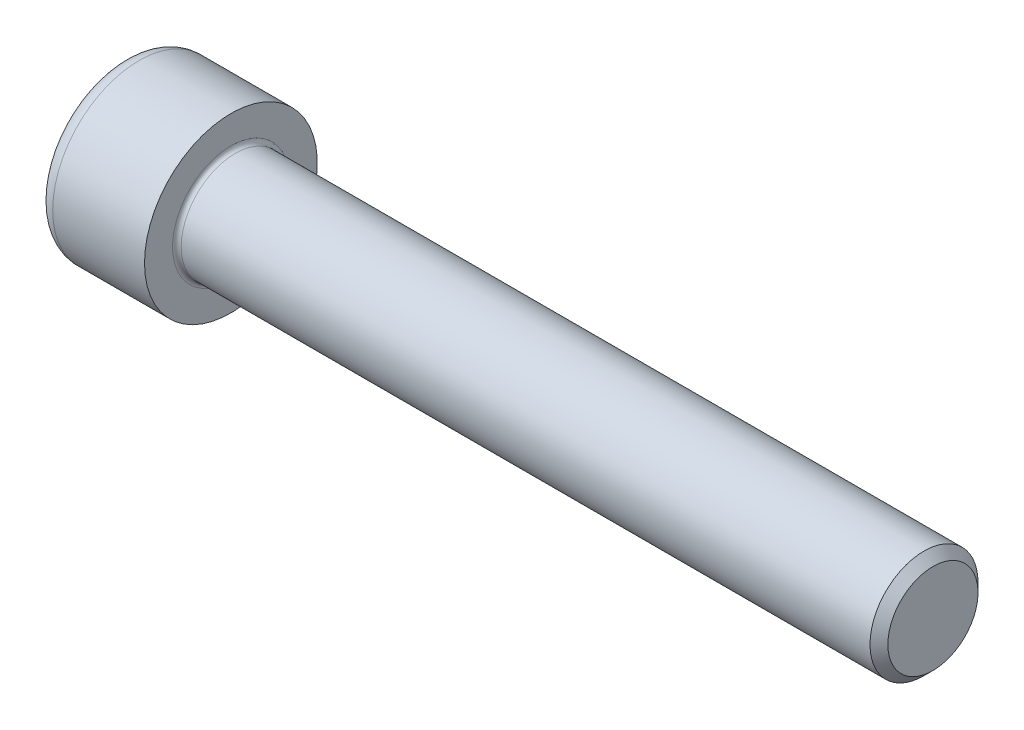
ISO-10303-21;
HEADER;
FILE_DESCRIPTION(('STEP AP214'),'2;1');
FILE_NAME('part.step','',(''),(''),'','','');
FILE_SCHEMA(('AUTOMOTIVE_DESIGN { 1 0 10303 214 1 1 1 1 }'));
ENDSEC;
DATA;
#1=APPLICATION_CONTEXT('core data for automotive mechanical design processes');
#2=APPLICATION_PROTOCOL_DEFINITION('international standard','automotive_design',2000,#1);
#3=PRODUCT_CONTEXT('',#1,'mechanical');
#4=PRODUCT('Part','Part','',(#3));
#5=PRODUCT_RELATED_PRODUCT_CATEGORY('part','',(#4));
#6=PRODUCT_DEFINITION_FORMATION('','',#4);
#7=PRODUCT_DEFINITION_CONTEXT('part definition',#1,'design');
#8=PRODUCT_DEFINITION('design','',#6,#7);
#9=PRODUCT_DEFINITION_SHAPE('','',#8);
#10=(LENGTH_UNIT() NAMED_UNIT(*) SI_UNIT(.MILLI.,.METRE.));
#11=(NAMED_UNIT(*) PLANE_ANGLE_UNIT() SI_UNIT($,.RADIAN.));
#12=(NAMED_UNIT(*) SI_UNIT($,.STERADIAN.) SOLID_ANGLE_UNIT());
#13=UNCERTAINTY_MEASURE_WITH_UNIT(LENGTH_MEASURE(1.E-05),#10,'distance_accuracy_value','');
#14=(GEOMETRIC_REPRESENTATION_CONTEXT(3) GLOBAL_UNCERTAINTY_ASSIGNED_CONTEXT((#13)) GLOBAL_UNIT_ASSIGNED_CONTEXT((#10,
#11,#12)) REPRESENTATION_CONTEXT('',''));
#15=CARTESIAN_POINT('',(0.,0.,0.));
#16=DIRECTION('',(0.,0.,1.));
#17=DIRECTION('',(1.,0.,0.));
#18=AXIS2_PLACEMENT_3D('',#15,#16,#17);
#19=CARTESIAN_POINT('',(0.,0.,0.));
#20=DIRECTION('',(-1.,0.,0.));
#21=DIRECTION('',(0.,0.,1.));
#22=AXIS2_PLACEMENT_3D('',#19,#20,#21);
#23=PLANE('',#22);
#24=DIRECTION('',(0.,-0.499999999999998,0.86602540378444));
#25=VECTOR('',#24,1.);
#26=CARTESIAN_POINT('',(0.,4.68519743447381,0.));
#27=LINE('',#26,#25);
#28=CARTESIAN_POINT('',(0.,4.68519743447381,0.));
#29=VERTEX_POINT('',#28);
#30=CARTESIAN_POINT('',(0.,2.34259871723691,4.0575));
#31=VERTEX_POINT('',#30);
#32=EDGE_CURVE('E259',#29,#31,#27,.T.);
#33=ORIENTED_EDGE('',*,*,#32,.T.);
#34=DIRECTION('',(0.,1.,0.));
#35=VECTOR('',#34,1.);
#36=CARTESIAN_POINT('',(0.,-2.3425987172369,4.0575));
#37=LINE('',#36,#35);
#38=CARTESIAN_POINT('',(0.,-2.3425987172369,4.0575));
#39=VERTEX_POINT('',#38);
#40=EDGE_CURVE('E131',#39,#31,#37,.T.);
#41=ORIENTED_EDGE('',*,*,#40,.F.);
#42=DIRECTION('',(0.,-0.500000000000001,-0.866025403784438));
#43=VECTOR('',#42,1.);
#44=CARTESIAN_POINT('',(0.,-2.3425987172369,4.0575));
#45=LINE('',#44,#43);
#46=CARTESIAN_POINT('',(0.,-4.68519743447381,0.));
#47=VERTEX_POINT('',#46);
#48=EDGE_CURVE('E262',#39,#47,#45,.T.);
#49=ORIENTED_EDGE('',*,*,#48,.T.);
#50=DIRECTION('',(0.,0.499999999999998,-0.86602540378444));
#51=VECTOR('',#50,1.);
#52=CARTESIAN_POINT('',(0.,-4.68519743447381,0.));
#53=LINE('',#52,#51);
#54=CARTESIAN_POINT('',(0.,-2.34259871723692,-4.0575));
#55=VERTEX_POINT('',#54);
#56=EDGE_CURVE('E265',#47,#55,#53,.T.);
#57=ORIENTED_EDGE('',*,*,#56,.T.);
#58=DIRECTION('',(0.,-1.,0.));
#59=VECTOR('',#58,1.);
#60=CARTESIAN_POINT('',(0.,2.34259871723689,-4.0575));
#61=LINE('',#60,#59);
#62=CARTESIAN_POINT('',(0.,2.34259871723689,-4.0575));
#63=VERTEX_POINT('',#62);
#64=EDGE_CURVE('E268',#63,#55,#61,.T.);
#65=ORIENTED_EDGE('',*,*,#64,.F.);
#66=DIRECTION('',(0.,-0.500000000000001,-0.866025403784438));
#67=VECTOR('',#66,1.);
#68=CARTESIAN_POINT('',(0.,4.68519743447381,0.));
#69=LINE('',#68,#67);
#70=EDGE_CURVE('E126',#29,#63,#69,.T.);
#71=ORIENTED_EDGE('',*,*,#70,.F.);
#72=EDGE_LOOP('',(#33,#41,#49,#57,#65,#71));
#73=FACE_BOUND('',#72,.T.);
#74=CARTESIAN_POINT('',(0.,0.,0.));
#75=DIRECTION('',(-1.,0.,0.));
#76=DIRECTION('',(0.,0.,1.));
#77=AXIS2_PLACEMENT_3D('',#74,#75,#76);
#78=CIRCLE('',#77,6.5);
#79=CARTESIAN_POINT('',(0.,0.,6.5));
#80=VERTEX_POINT('',#79);
#81=EDGE_CURVE('E43',#80,#80,#78,.T.);
#82=ORIENTED_EDGE('',*,*,#81,.T.);
#83=EDGE_LOOP('',(#82));
#84=FACE_BOUND('',#83,.T.);
#85=ADVANCED_FACE('F35',(#73,#84),#23,.T.);
#86=CARTESIAN_POINT('',(-31.75,0.,0.));
#87=DIRECTION('',(-1.,0.,0.));
#88=DIRECTION('',(0.,0.,1.));
#89=AXIS2_PLACEMENT_3D('',#86,#87,#88);
#90=CYLINDRICAL_SURFACE('',#89,8.);
#91=CARTESIAN_POINT('',(1.5,0.,0.));
#92=DIRECTION('',(-1.,0.,0.));
#93=DIRECTION('',(0.,0.,1.));
#94=AXIS2_PLACEMENT_3D('',#91,#92,#93);
#95=CIRCLE('',#94,8.);
#96=CARTESIAN_POINT('',(1.5,0.,8.));
#97=VERTEX_POINT('',#96);
#98=EDGE_CURVE('E11',#97,#97,#95,.F.);
#99=ORIENTED_EDGE('',*,*,#98,.T.);
#100=EDGE_LOOP('',(#99));
#101=FACE_BOUND('',#100,.T.);
#102=CARTESIAN_POINT('',(10.,0.,0.));
#103=DIRECTION('',(-1.,0.,0.));
#104=DIRECTION('',(0.,0.,1.));
#105=AXIS2_PLACEMENT_3D('',#102,#103,#104);
#106=CIRCLE('',#105,8.);
#107=CARTESIAN_POINT('',(10.,0.,8.));
#108=VERTEX_POINT('',#107);
#109=EDGE_CURVE('E149',#108,#108,#106,.T.);
#110=ORIENTED_EDGE('',*,*,#109,.T.);
#111=EDGE_LOOP('',(#110));
#112=FACE_BOUND('',#111,.T.);
#113=ADVANCED_FACE('F173',(#101,#112),#90,.T.);
#114=CARTESIAN_POINT('',(10.,8.,0.));
#115=DIRECTION('',(1.,0.,0.));
#116=DIRECTION('',(0.,0.,-1.));
#117=AXIS2_PLACEMENT_3D('',#114,#115,#116);
#118=PLANE('',#117);
#119=CARTESIAN_POINT('',(10.,0.,0.));
#120=DIRECTION('',(1.,0.,0.));
#121=DIRECTION('',(0.,0.,-1.));
#122=AXIS2_PLACEMENT_3D('',#119,#120,#121);
#123=CIRCLE('',#122,5.39999999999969);
#124=CARTESIAN_POINT('',(10.,0.,-5.39999999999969));
#125=VERTEX_POINT('',#124);
#126=EDGE_CURVE('E152',#125,#125,#123,.F.);
#127=ORIENTED_EDGE('',*,*,#126,.T.);
#128=EDGE_LOOP('',(#127));
#129=FACE_BOUND('',#128,.T.);
#130=ORIENTED_EDGE('',*,*,#109,.F.);
#131=EDGE_LOOP('',(#130));
#132=FACE_BOUND('',#131,.T.);
#133=ADVANCED_FACE('F179',(#129,#132),#118,.T.);
#134=CARTESIAN_POINT('',(-31.75,0.,0.));
#135=DIRECTION('',(-1.,0.,0.));
#136=DIRECTION('',(0.,0.,1.));
#137=AXIS2_PLACEMENT_3D('',#134,#135,#136);
#138=CYLINDRICAL_SURFACE('',#137,4.99999999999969);
#139=CARTESIAN_POINT('',(10.4,0.,0.));
#140=DIRECTION('',(1.,0.,0.));
#141=DIRECTION('',(0.,0.,-1.));
#142=AXIS2_PLACEMENT_3D('',#139,#140,#141);
#143=CIRCLE('',#142,4.99999999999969);
#144=CARTESIAN_POINT('',(10.4,0.,-4.99999999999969));
#145=VERTEX_POINT('',#144);
#146=EDGE_CURVE('E155',#145,#145,#143,.T.);
#147=ORIENTED_EDGE('',*,*,#146,.T.);
#148=EDGE_LOOP('',(#147));
#149=FACE_BOUND('',#148,.T.);
#150=CARTESIAN_POINT('',(74.1719999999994,0.,0.));
#151=DIRECTION('',(-1.,0.,0.));
#152=DIRECTION('',(0.,0.,1.));
#153=AXIS2_PLACEMENT_3D('',#150,#151,#152);
#154=CIRCLE('',#153,4.99999999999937);
#155=CARTESIAN_POINT('',(74.1719999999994,0.,4.99999999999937));
#156=VERTEX_POINT('',#155);
#157=EDGE_CURVE('E146',#156,#156,#154,.T.);
#158=ORIENTED_EDGE('',*,*,#157,.T.);
#159=EDGE_LOOP('',(#158));
#160=FACE_BOUND('',#159,.T.);
#161=ADVANCED_FACE('F185',(#149,#160),#138,.T.);
#162=CARTESIAN_POINT('',(75.,0.,0.));
#163=DIRECTION('',(-1.,0.,0.));
#164=DIRECTION('',(0.,0.,1.));
#165=AXIS2_PLACEMENT_3D('',#162,#163,#164);
#166=CONICAL_SURFACE('',#165,4.172,0.785398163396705);
#167=ORIENTED_EDGE('',*,*,#157,.F.);
#168=EDGE_LOOP('',(#167));
#169=FACE_BOUND('',#168,.T.);
#170=CARTESIAN_POINT('',(75.,0.,0.));
#171=DIRECTION('',(-1.,0.,0.));
#172=DIRECTION('',(0.,0.,1.));
#173=AXIS2_PLACEMENT_3D('',#170,#171,#172);
#174=CIRCLE('',#173,4.172);
#175=CARTESIAN_POINT('',(75.,0.,4.172));
#176=VERTEX_POINT('',#175);
#177=EDGE_CURVE('E142',#176,#176,#174,.T.);
#178=ORIENTED_EDGE('',*,*,#177,.T.);
#179=EDGE_LOOP('',(#178));
#180=FACE_BOUND('',#179,.T.);
#181=ADVANCED_FACE('F189',(#169,#180),#166,.T.);
#182=CARTESIAN_POINT('',(75.,4.172,0.));
#183=DIRECTION('',(1.,0.,0.));
#184=DIRECTION('',(0.,0.,-1.));
#185=AXIS2_PLACEMENT_3D('',#182,#183,#184);
#186=PLANE('',#185);
#187=ORIENTED_EDGE('',*,*,#177,.F.);
#188=EDGE_LOOP('',(#187));
#189=FACE_BOUND('',#188,.T.);
#190=ADVANCED_FACE('F169',(#189),#186,.T.);
#191=CARTESIAN_POINT('',(10.4,0.,0.));
#192=DIRECTION('',(1.,0.,0.));
#193=DIRECTION('',(0.,0.,-1.));
#194=AXIS2_PLACEMENT_3D('',#191,#192,#193);
#195=TOROIDAL_SURFACE('',#194,5.39999999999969,0.4);
#196=ORIENTED_EDGE('',*,*,#146,.F.);
#197=EDGE_LOOP('',(#196));
#198=FACE_BOUND('',#197,.T.);
#199=ORIENTED_EDGE('',*,*,#126,.F.);
#200=EDGE_LOOP('',(#199));
#201=FACE_BOUND('',#200,.T.);
#202=ADVANCED_FACE('F162',(#198,#201),#195,.F.);
#203=CARTESIAN_POINT('',(1.5,0.,0.));
#204=DIRECTION('',(-1.,0.,0.));
#205=DIRECTION('',(0.,0.,1.));
#206=AXIS2_PLACEMENT_3D('',#203,#204,#205);
#207=TOROIDAL_SURFACE('',#206,6.5,1.5);
#208=ORIENTED_EDGE('',*,*,#98,.F.);
#209=EDGE_LOOP('',(#208));
#210=FACE_BOUND('',#209,.T.);
#211=ORIENTED_EDGE('',*,*,#81,.F.);
#212=EDGE_LOOP('',(#211));
#213=FACE_BOUND('',#212,.T.);
#214=ADVANCED_FACE('F37',(#210,#213),#207,.T.);
#215=CARTESIAN_POINT('',(5.,4.68519743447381,0.));
#216=DIRECTION('',(0.,-0.86602540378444,-0.499999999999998));
#217=DIRECTION('',(0.,0.499999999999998,-0.86602540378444));
#218=AXIS2_PLACEMENT_3D('',#215,#216,#217);
#219=PLANE('',#218);
#220=ORIENTED_EDGE('',*,*,#32,.F.);
#221=DIRECTION('',(-1.,0.,0.));
#222=VECTOR('',#221,1.);
#223=CARTESIAN_POINT('',(5.,4.68519743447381,0.));
#224=LINE('',#223,#222);
#225=CARTESIAN_POINT('',(5.,4.68519743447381,0.));
#226=VERTEX_POINT('',#225);
#227=EDGE_CURVE('E249',#226,#29,#224,.T.);
#228=ORIENTED_EDGE('',*,*,#227,.F.);
#229=DIRECTION('',(0.,-0.499999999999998,0.86602540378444));
#230=VECTOR('',#229,1.);
#231=CARTESIAN_POINT('',(5.,4.68519743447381,0.));
#232=LINE('',#231,#230);
#233=CARTESIAN_POINT('',(5.,3.51389807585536,2.02874999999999));
#234=VERTEX_POINT('',#233);
#235=EDGE_CURVE('E118',#226,#234,#232,.T.);
#236=ORIENTED_EDGE('',*,*,#235,.T.);
#237=CARTESIAN_POINT('',(5.,2.34259871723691,4.0575));
#238=VERTEX_POINT('',#237);
#239=EDGE_CURVE('E109',#234,#238,#232,.T.);
#240=ORIENTED_EDGE('',*,*,#239,.T.);
#241=DIRECTION('',(-1.,0.,0.));
#242=VECTOR('',#241,1.);
#243=CARTESIAN_POINT('',(5.,2.34259871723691,4.0575));
#244=LINE('',#243,#242);
#245=EDGE_CURVE('E123',#238,#31,#244,.T.);
#246=ORIENTED_EDGE('',*,*,#245,.T.);
#247=EDGE_LOOP('',(#220,#228,#236,#240,#246));
#248=FACE_BOUND('',#247,.T.);
#249=ADVANCED_FACE('F122',(#248),#219,.T.);
#250=CARTESIAN_POINT('',(5.,-2.3425987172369,4.0575));
#251=DIRECTION('',(0.,0.,1.));
#252=DIRECTION('',(0.,-1.,0.));
#253=AXIS2_PLACEMENT_3D('',#250,#251,#252);
#254=PLANE('',#253);
#255=ORIENTED_EDGE('',*,*,#40,.T.);
#256=ORIENTED_EDGE('',*,*,#245,.F.);
#257=DIRECTION('',(0.,1.,0.));
#258=VECTOR('',#257,1.);
#259=CARTESIAN_POINT('',(5.,-2.3425987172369,4.0575));
#260=LINE('',#259,#258);
#261=CARTESIAN_POINT('',(5.,0.,4.0575));
#262=VERTEX_POINT('',#261);
#263=EDGE_CURVE('E106',#262,#238,#260,.T.);
#264=ORIENTED_EDGE('',*,*,#263,.F.);
#265=CARTESIAN_POINT('',(5.,-2.3425987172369,4.0575));
#266=VERTEX_POINT('',#265);
#267=EDGE_CURVE('E117',#266,#262,#260,.T.);
#268=ORIENTED_EDGE('',*,*,#267,.F.);
#269=DIRECTION('',(-1.,0.,0.));
#270=VECTOR('',#269,1.);
#271=CARTESIAN_POINT('',(5.,-2.3425987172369,4.0575));
#272=LINE('',#271,#270);
#273=EDGE_CURVE('E133',#266,#39,#272,.T.);
#274=ORIENTED_EDGE('',*,*,#273,.T.);
#275=EDGE_LOOP('',(#255,#256,#264,#268,#274));
#276=FACE_BOUND('',#275,.T.);
#277=ADVANCED_FACE('F128',(#276),#254,.F.);
#278=CARTESIAN_POINT('',(5.,-2.3425987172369,4.0575));
#279=DIRECTION('',(0.,0.866025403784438,-0.500000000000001));
#280=DIRECTION('',(0.,0.500000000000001,0.866025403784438));
#281=AXIS2_PLACEMENT_3D('',#278,#279,#280);
#282=PLANE('',#281);
#283=ORIENTED_EDGE('',*,*,#48,.F.);
#284=ORIENTED_EDGE('',*,*,#273,.F.);
#285=DIRECTION('',(0.,-0.500000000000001,-0.866025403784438));
#286=VECTOR('',#285,1.);
#287=CARTESIAN_POINT('',(5.,-2.3425987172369,4.0575));
#288=LINE('',#287,#286);
#289=CARTESIAN_POINT('',(5.,-3.51389807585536,2.02875));
#290=VERTEX_POINT('',#289);
#291=EDGE_CURVE('E288',#266,#290,#288,.T.);
#292=ORIENTED_EDGE('',*,*,#291,.T.);
#293=CARTESIAN_POINT('',(5.,-4.68519743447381,0.));
#294=VERTEX_POINT('',#293);
#295=EDGE_CURVE('E277',#290,#294,#288,.T.);
#296=ORIENTED_EDGE('',*,*,#295,.T.);
#297=DIRECTION('',(-1.,0.,0.));
#298=VECTOR('',#297,1.);
#299=CARTESIAN_POINT('',(5.,-4.68519743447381,0.));
#300=LINE('',#299,#298);
#301=EDGE_CURVE('E138',#294,#47,#300,.T.);
#302=ORIENTED_EDGE('',*,*,#301,.T.);
#303=EDGE_LOOP('',(#283,#284,#292,#296,#302));
#304=FACE_BOUND('',#303,.T.);
#305=ADVANCED_FACE('F203',(#304),#282,.T.);
#306=CARTESIAN_POINT('',(5.,-4.68519743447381,0.));
#307=DIRECTION('',(0.,0.86602540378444,0.499999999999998));
#308=DIRECTION('',(0.,-0.499999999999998,0.86602540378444));
#309=AXIS2_PLACEMENT_3D('',#306,#307,#308);
#310=PLANE('',#309);
#311=ORIENTED_EDGE('',*,*,#56,.F.);
#312=ORIENTED_EDGE('',*,*,#301,.F.);
#313=DIRECTION('',(0.,0.499999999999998,-0.86602540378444));
#314=VECTOR('',#313,1.);
#315=CARTESIAN_POINT('',(5.,-4.68519743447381,0.));
#316=LINE('',#315,#314);
#317=CARTESIAN_POINT('',(5.,-3.51389807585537,-2.02874999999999));
#318=VERTEX_POINT('',#317);
#319=EDGE_CURVE('E255',#294,#318,#316,.T.);
#320=ORIENTED_EDGE('',*,*,#319,.T.);
#321=CARTESIAN_POINT('',(5.,-2.34259871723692,-4.0575));
#322=VERTEX_POINT('',#321);
#323=EDGE_CURVE('E287',#318,#322,#316,.T.);
#324=ORIENTED_EDGE('',*,*,#323,.T.);
#325=DIRECTION('',(-1.,0.,0.));
#326=VECTOR('',#325,1.);
#327=CARTESIAN_POINT('',(5.,-2.34259871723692,-4.0575));
#328=LINE('',#327,#326);
#329=EDGE_CURVE('E248',#322,#55,#328,.T.);
#330=ORIENTED_EDGE('',*,*,#329,.T.);
#331=EDGE_LOOP('',(#311,#312,#320,#324,#330));
#332=FACE_BOUND('',#331,.T.);
#333=ADVANCED_FACE('F206',(#332),#310,.T.);
#334=CARTESIAN_POINT('',(5.,2.34259871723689,-4.0575));
#335=DIRECTION('',(0.,0.,-1.));
#336=DIRECTION('',(0.,1.,0.));
#337=AXIS2_PLACEMENT_3D('',#334,#335,#336);
#338=PLANE('',#337);
#339=ORIENTED_EDGE('',*,*,#64,.T.);
#340=ORIENTED_EDGE('',*,*,#329,.F.);
#341=DIRECTION('',(0.,-1.,0.));
#342=VECTOR('',#341,1.);
#343=CARTESIAN_POINT('',(5.,2.34259871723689,-4.0575));
#344=LINE('',#343,#342);
#345=CARTESIAN_POINT('',(5.,0.,-4.0575));
#346=VERTEX_POINT('',#345);
#347=EDGE_CURVE('E252',#346,#322,#344,.T.);
#348=ORIENTED_EDGE('',*,*,#347,.F.);
#349=CARTESIAN_POINT('',(5.,2.34259871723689,-4.0575));
#350=VERTEX_POINT('',#349);
#351=EDGE_CURVE('E50',#350,#346,#344,.T.);
#352=ORIENTED_EDGE('',*,*,#351,.F.);
#353=DIRECTION('',(-1.,0.,0.));
#354=VECTOR('',#353,1.);
#355=CARTESIAN_POINT('',(5.,2.34259871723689,-4.0575));
#356=LINE('',#355,#354);
#357=EDGE_CURVE('E245',#350,#63,#356,.T.);
#358=ORIENTED_EDGE('',*,*,#357,.T.);
#359=EDGE_LOOP('',(#339,#340,#348,#352,#358));
#360=FACE_BOUND('',#359,.T.);
#361=ADVANCED_FACE('F210',(#360),#338,.F.);
#362=CARTESIAN_POINT('',(5.,4.68519743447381,0.));
#363=DIRECTION('',(0.,0.866025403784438,-0.500000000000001));
#364=DIRECTION('',(0.,0.500000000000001,0.866025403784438));
#365=AXIS2_PLACEMENT_3D('',#362,#363,#364);
#366=PLANE('',#365);
#367=ORIENTED_EDGE('',*,*,#70,.T.);
#368=ORIENTED_EDGE('',*,*,#357,.F.);
#369=DIRECTION('',(0.,-0.500000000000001,-0.866025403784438));
#370=VECTOR('',#369,1.);
#371=CARTESIAN_POINT('',(5.,4.68519743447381,0.));
#372=LINE('',#371,#370);
#373=CARTESIAN_POINT('',(5.,3.51389807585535,-2.02875));
#374=VERTEX_POINT('',#373);
#375=EDGE_CURVE('E235',#374,#350,#372,.T.);
#376=ORIENTED_EDGE('',*,*,#375,.F.);
#377=EDGE_CURVE('E241',#226,#374,#372,.T.);
#378=ORIENTED_EDGE('',*,*,#377,.F.);
#379=ORIENTED_EDGE('',*,*,#227,.T.);
#380=EDGE_LOOP('',(#367,#368,#376,#378,#379));
#381=FACE_BOUND('',#380,.T.);
#382=ADVANCED_FACE('F214',(#381),#366,.F.);
#383=CARTESIAN_POINT('',(5.,7.0277961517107,-4.0575));
#384=DIRECTION('',(1.,0.,0.));
#385=DIRECTION('',(0.,0.,-1.));
#386=AXIS2_PLACEMENT_3D('',#383,#384,#385);
#387=PLANE('',#386);
#388=ORIENTED_EDGE('',*,*,#347,.T.);
#389=ORIENTED_EDGE('',*,*,#323,.F.);
#390=CARTESIAN_POINT('',(5.,0.,0.));
#391=DIRECTION('',(-1.,0.,0.));
#392=DIRECTION('',(0.,0.,1.));
#393=AXIS2_PLACEMENT_3D('',#390,#391,#392);
#394=CIRCLE('',#393,4.0575);
#395=EDGE_CURVE('E283',#346,#318,#394,.T.);
#396=ORIENTED_EDGE('',*,*,#395,.F.);
#397=EDGE_LOOP('',(#388,#389,#396));
#398=FACE_BOUND('',#397,.T.);
#399=ADVANCED_FACE('F218',(#398),#387,.F.);
#400=ORIENTED_EDGE('',*,*,#319,.F.);
#401=ORIENTED_EDGE('',*,*,#295,.F.);
#402=EDGE_CURVE('E136',#318,#290,#394,.T.);
#403=ORIENTED_EDGE('',*,*,#402,.F.);
#404=EDGE_LOOP('',(#400,#401,#403));
#405=FACE_BOUND('',#404,.T.);
#406=ADVANCED_FACE('F221',(#405),#387,.F.);
#407=ORIENTED_EDGE('',*,*,#291,.F.);
#408=ORIENTED_EDGE('',*,*,#267,.T.);
#409=EDGE_CURVE('E132',#290,#262,#394,.T.);
#410=ORIENTED_EDGE('',*,*,#409,.F.);
#411=EDGE_LOOP('',(#407,#408,#410));
#412=FACE_BOUND('',#411,.T.);
#413=ADVANCED_FACE('F226',(#412),#387,.F.);
#414=ORIENTED_EDGE('',*,*,#263,.T.);
#415=ORIENTED_EDGE('',*,*,#239,.F.);
#416=EDGE_CURVE('E112',#262,#234,#394,.T.);
#417=ORIENTED_EDGE('',*,*,#416,.F.);
#418=EDGE_LOOP('',(#414,#415,#417));
#419=FACE_BOUND('',#418,.T.);
#420=ADVANCED_FACE('F108',(#419),#387,.F.);
#421=ORIENTED_EDGE('',*,*,#235,.F.);
#422=ORIENTED_EDGE('',*,*,#377,.T.);
#423=EDGE_CURVE('E143',#234,#374,#394,.T.);
#424=ORIENTED_EDGE('',*,*,#423,.F.);
#425=EDGE_LOOP('',(#421,#422,#424));
#426=FACE_BOUND('',#425,.T.);
#427=ADVANCED_FACE('F229',(#426),#387,.F.);
#428=ORIENTED_EDGE('',*,*,#375,.T.);
#429=ORIENTED_EDGE('',*,*,#351,.T.);
#430=EDGE_CURVE('E238',#374,#346,#394,.T.);
#431=ORIENTED_EDGE('',*,*,#430,.F.);
#432=EDGE_LOOP('',(#428,#429,#431));
#433=FACE_BOUND('',#432,.T.);
#434=ADVANCED_FACE('F199',(#433),#387,.F.);
#435=CARTESIAN_POINT('',(5.,0.,0.));
#436=DIRECTION('',(-1.,0.,0.));
#437=DIRECTION('',(0.,0.,1.));
#438=AXIS2_PLACEMENT_3D('',#435,#436,#437);
#439=CONICAL_SURFACE('',#438,4.0575,1.04719755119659);
#440=CARTESIAN_POINT('',(7.34259871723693,0.,0.));
#441=VERTEX_POINT('',#440);
#442=VERTEX_LOOP('',#441);
#443=FACE_BOUND('',#442,.T.);
#444=ORIENTED_EDGE('',*,*,#416,.T.);
#445=ORIENTED_EDGE('',*,*,#423,.T.);
#446=ORIENTED_EDGE('',*,*,#430,.T.);
#447=ORIENTED_EDGE('',*,*,#395,.T.);
#448=ORIENTED_EDGE('',*,*,#402,.T.);
#449=ORIENTED_EDGE('',*,*,#409,.T.);
#450=EDGE_LOOP('',(#444,#445,#446,#447,#448,#449));
#451=FACE_BOUND('',#450,.T.);
#452=ADVANCED_FACE('F197',(#443,#451),#439,.F.);
#453=CLOSED_SHELL('',(#85,#113,#133,#161,#181,#190,#202,#214,#249,#277,#305,#333,#361,#382,#399,
#406,#413,#420,#427,#434,#452));
#454=MANIFOLD_SOLID_BREP('B2',#453);
#455=ADVANCED_BREP_SHAPE_REPRESENTATION('',(#18,#454),#14);
#456=SHAPE_DEFINITION_REPRESENTATION(#9,#455);
ENDSEC;
END-ISO-10303-21;
